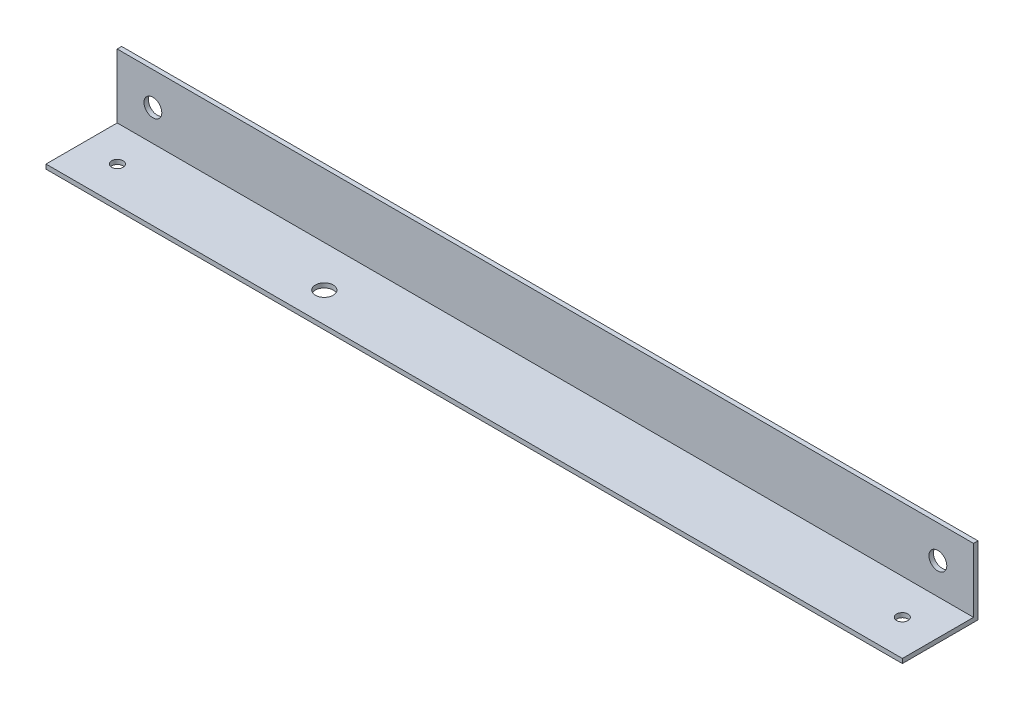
ISO-10303-21;
HEADER;
FILE_DESCRIPTION(('STEP AP214'),'2;1');
FILE_NAME('part.step','',(''),(''),'','','');
FILE_SCHEMA(('AUTOMOTIVE_DESIGN { 1 0 10303 214 1 1 1 1 }'));
ENDSEC;
DATA;
#1=APPLICATION_CONTEXT('core data for automotive mechanical design processes');
#2=APPLICATION_PROTOCOL_DEFINITION('international standard','automotive_design',2000,#1);
#3=PRODUCT_CONTEXT('',#1,'mechanical');
#4=PRODUCT('Part','Part','',(#3));
#5=PRODUCT_RELATED_PRODUCT_CATEGORY('part','',(#4));
#6=PRODUCT_DEFINITION_FORMATION('','',#4);
#7=PRODUCT_DEFINITION_CONTEXT('part definition',#1,'design');
#8=PRODUCT_DEFINITION('design','',#6,#7);
#9=PRODUCT_DEFINITION_SHAPE('','',#8);
#10=(LENGTH_UNIT() NAMED_UNIT(*) SI_UNIT(.MILLI.,.METRE.));
#11=(NAMED_UNIT(*) PLANE_ANGLE_UNIT() SI_UNIT($,.RADIAN.));
#12=(NAMED_UNIT(*) SI_UNIT($,.STERADIAN.) SOLID_ANGLE_UNIT());
#13=UNCERTAINTY_MEASURE_WITH_UNIT(LENGTH_MEASURE(1.E-05),#10,'distance_accuracy_value','');
#14=(GEOMETRIC_REPRESENTATION_CONTEXT(3) GLOBAL_UNCERTAINTY_ASSIGNED_CONTEXT((#13)) GLOBAL_UNIT_ASSIGNED_CONTEXT((#10,
#11,#12)) REPRESENTATION_CONTEXT('',''));
#15=CARTESIAN_POINT('',(0.,0.,0.));
#16=DIRECTION('',(0.,0.,1.));
#17=DIRECTION('',(1.,0.,0.));
#18=AXIS2_PLACEMENT_3D('',#15,#16,#17);
#19=CARTESIAN_POINT('',(0.,0.,26.924));
#20=DIRECTION('',(0.,0.,1.));
#21=DIRECTION('',(1.,0.,0.));
#22=AXIS2_PLACEMENT_3D('',#19,#20,#21);
#23=PLANE('',#22);
#24=DIRECTION('',(1.,0.,0.));
#25=VECTOR('',#24,1.);
#26=CARTESIAN_POINT('',(-209.826086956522,45.0420093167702,26.924));
#27=LINE('',#26,#25);
#28=CARTESIAN_POINT('',(-209.826086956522,45.0420093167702,26.924));
#29=VERTEX_POINT('',#28);
#30=CARTESIAN_POINT('',(94.9739130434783,45.0420093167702,26.924));
#31=VERTEX_POINT('',#30);
#32=EDGE_CURVE('E119',#29,#31,#27,.T.);
#33=ORIENTED_EDGE('',*,*,#32,.F.);
#34=DIRECTION('',(0.,-1.,0.));
#35=VECTOR('',#34,1.);
#36=CARTESIAN_POINT('',(-209.826086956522,67.8385093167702,26.924));
#37=LINE('',#36,#35);
#38=CARTESIAN_POINT('',(-209.826086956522,43.4545093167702,26.924));
#39=VERTEX_POINT('',#38);
#40=EDGE_CURVE('E96',#29,#39,#37,.T.);
#41=ORIENTED_EDGE('',*,*,#40,.T.);
#42=DIRECTION('',(1.,0.,0.));
#43=VECTOR('',#42,1.);
#44=CARTESIAN_POINT('',(-209.826086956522,43.4545093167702,26.924));
#45=LINE('',#44,#43);
#46=CARTESIAN_POINT('',(94.9739130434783,43.4545093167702,26.924));
#47=VERTEX_POINT('',#46);
#48=EDGE_CURVE('E58',#39,#47,#45,.T.);
#49=ORIENTED_EDGE('',*,*,#48,.T.);
#50=DIRECTION('',(0.,1.,0.));
#51=VECTOR('',#50,1.);
#52=CARTESIAN_POINT('',(94.9739130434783,67.8385093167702,26.924));
#53=LINE('',#52,#51);
#54=EDGE_CURVE('E89',#47,#31,#53,.T.);
#55=ORIENTED_EDGE('',*,*,#54,.T.);
#56=EDGE_LOOP('',(#33,#41,#49,#55));
#57=FACE_BOUND('',#56,.T.);
#58=ADVANCED_FACE('F39',(#57),#23,.T.);
#59=CARTESIAN_POINT('',(-209.826086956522,67.8385093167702,26.924));
#60=DIRECTION('',(1.,0.,0.));
#61=DIRECTION('',(0.,0.,-1.));
#62=AXIS2_PLACEMENT_3D('',#59,#60,#61);
#63=PLANE('',#62);
#64=DIRECTION('',(0.,0.,1.));
#65=VECTOR('',#64,1.);
#66=CARTESIAN_POINT('',(-209.826086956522,45.0420093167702,-303.37967743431));
#67=LINE('',#66,#65);
#68=CARTESIAN_POINT('',(-209.826086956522,45.0420093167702,1.58750000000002));
#69=VERTEX_POINT('',#68);
#70=EDGE_CURVE('E144',#69,#29,#67,.T.);
#71=ORIENTED_EDGE('',*,*,#70,.F.);
#72=DIRECTION('',(0.,1.,0.));
#73=VECTOR('',#72,1.);
#74=CARTESIAN_POINT('',(-209.826086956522,55.1385093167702,1.5875));
#75=LINE('',#74,#73);
#76=CARTESIAN_POINT('',(-209.826086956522,67.8385093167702,1.5875));
#77=VERTEX_POINT('',#76);
#78=EDGE_CURVE('E88',#69,#77,#75,.T.);
#79=ORIENTED_EDGE('',*,*,#78,.T.);
#80=DIRECTION('',(0.,0.,-1.));
#81=VECTOR('',#80,1.);
#82=CARTESIAN_POINT('',(-209.826086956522,67.8385093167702,26.924));
#83=LINE('',#82,#81);
#84=CARTESIAN_POINT('',(-209.826086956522,67.8385093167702,0.));
#85=VERTEX_POINT('',#84);
#86=EDGE_CURVE('E82',#77,#85,#83,.T.);
#87=ORIENTED_EDGE('',*,*,#86,.T.);
#88=DIRECTION('',(0.,-1.,0.));
#89=VECTOR('',#88,1.);
#90=CARTESIAN_POINT('',(-209.826086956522,67.8385093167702,0.));
#91=LINE('',#90,#89);
#92=CARTESIAN_POINT('',(-209.826086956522,43.4545093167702,0.));
#93=VERTEX_POINT('',#92);
#94=EDGE_CURVE('E86',#85,#93,#91,.T.);
#95=ORIENTED_EDGE('',*,*,#94,.T.);
#96=DIRECTION('',(0.,0.,-1.));
#97=VECTOR('',#96,1.);
#98=CARTESIAN_POINT('',(-209.826086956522,43.4545093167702,26.924));
#99=LINE('',#98,#97);
#100=EDGE_CURVE('E11',#39,#93,#99,.T.);
#101=ORIENTED_EDGE('',*,*,#100,.F.);
#102=ORIENTED_EDGE('',*,*,#40,.F.);
#103=EDGE_LOOP('',(#71,#79,#87,#95,#101,#102));
#104=FACE_BOUND('',#103,.T.);
#105=ADVANCED_FACE('F41',(#104),#63,.F.);
#106=CARTESIAN_POINT('',(-209.826086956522,43.4545093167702,26.924));
#107=DIRECTION('',(0.,1.,0.));
#108=DIRECTION('',(0.,0.,1.));
#109=AXIS2_PLACEMENT_3D('',#106,#107,#108);
#110=PLANE('',#109);
#111=CARTESIAN_POINT('',(-121.433339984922,43.4545093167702,16.256));
#112=DIRECTION('',(0.,-1.,0.));
#113=DIRECTION('',(0.,0.,-1.));
#114=AXIS2_PLACEMENT_3D('',#111,#112,#113);
#115=CIRCLE('',#114,3.175);
#116=CARTESIAN_POINT('',(-121.433339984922,43.4545093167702,13.081));
#117=VERTEX_POINT('',#116);
#118=EDGE_CURVE('E324',#117,#117,#115,.T.);
#119=ORIENTED_EDGE('',*,*,#118,.F.);
#120=EDGE_LOOP('',(#119));
#121=FACE_BOUND('',#120,.T.);
#122=CARTESIAN_POINT('',(-197.126086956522,43.4545093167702,14.224));
#123=DIRECTION('',(0.,-1.,0.));
#124=DIRECTION('',(0.,0.,-1.));
#125=AXIS2_PLACEMENT_3D('',#122,#123,#124);
#126=CIRCLE('',#125,2.03200000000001);
#127=CARTESIAN_POINT('',(-197.126086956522,43.4545093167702,12.192));
#128=VERTEX_POINT('',#127);
#129=EDGE_CURVE('E123',#128,#128,#126,.T.);
#130=ORIENTED_EDGE('',*,*,#129,.F.);
#131=EDGE_LOOP('',(#130));
#132=FACE_BOUND('',#131,.T.);
#133=CARTESIAN_POINT('',(82.2739130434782,43.4545093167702,14.224));
#134=DIRECTION('',(0.,-1.,0.));
#135=DIRECTION('',(0.,0.,1.));
#136=AXIS2_PLACEMENT_3D('',#133,#134,#135);
#137=CIRCLE('',#136,2.03200000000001);
#138=CARTESIAN_POINT('',(82.2739130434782,43.4545093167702,16.256));
#139=VERTEX_POINT('',#138);
#140=EDGE_CURVE('E327',#139,#139,#137,.T.);
#141=ORIENTED_EDGE('',*,*,#140,.F.);
#142=EDGE_LOOP('',(#141));
#143=FACE_BOUND('',#142,.T.);
#144=DIRECTION('',(1.,0.,0.));
#145=VECTOR('',#144,1.);
#146=CARTESIAN_POINT('',(-209.826086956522,43.4545093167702,0.));
#147=LINE('',#146,#145);
#148=CARTESIAN_POINT('',(94.9739130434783,43.4545093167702,0.));
#149=VERTEX_POINT('',#148);
#150=EDGE_CURVE('E100',#93,#149,#147,.T.);
#151=ORIENTED_EDGE('',*,*,#150,.T.);
#152=DIRECTION('',(0.,0.,-1.));
#153=VECTOR('',#152,1.);
#154=CARTESIAN_POINT('',(94.9739130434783,43.4545093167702,26.924));
#155=LINE('',#154,#153);
#156=EDGE_CURVE('E49',#47,#149,#155,.T.);
#157=ORIENTED_EDGE('',*,*,#156,.F.);
#158=ORIENTED_EDGE('',*,*,#48,.F.);
#159=ORIENTED_EDGE('',*,*,#100,.T.);
#160=EDGE_LOOP('',(#151,#157,#158,#159));
#161=FACE_BOUND('',#160,.T.);
#162=ADVANCED_FACE('F175',(#121,#132,#143,#161),#110,.F.);
#163=CARTESIAN_POINT('',(94.9739130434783,67.8385093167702,26.924));
#164=DIRECTION('',(-1.,0.,0.));
#165=DIRECTION('',(0.,0.,1.));
#166=AXIS2_PLACEMENT_3D('',#163,#164,#165);
#167=PLANE('',#166);
#168=DIRECTION('',(0.,1.,0.));
#169=VECTOR('',#168,1.);
#170=CARTESIAN_POINT('',(94.9739130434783,55.1385093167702,1.5875));
#171=LINE('',#170,#169);
#172=CARTESIAN_POINT('',(94.9739130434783,45.0420093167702,1.58750000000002));
#173=VERTEX_POINT('',#172);
#174=CARTESIAN_POINT('',(94.9739130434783,67.8385093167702,1.5875));
#175=VERTEX_POINT('',#174);
#176=EDGE_CURVE('E103',#173,#175,#171,.T.);
#177=ORIENTED_EDGE('',*,*,#176,.F.);
#178=DIRECTION('',(0.,0.,1.));
#179=VECTOR('',#178,1.);
#180=CARTESIAN_POINT('',(94.9739130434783,45.0420093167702,-303.37967743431));
#181=LINE('',#180,#179);
#182=EDGE_CURVE('E141',#173,#31,#181,.T.);
#183=ORIENTED_EDGE('',*,*,#182,.T.);
#184=ORIENTED_EDGE('',*,*,#54,.F.);
#185=ORIENTED_EDGE('',*,*,#156,.T.);
#186=DIRECTION('',(0.,1.,0.));
#187=VECTOR('',#186,1.);
#188=CARTESIAN_POINT('',(94.9739130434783,67.8385093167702,0.));
#189=LINE('',#188,#187);
#190=CARTESIAN_POINT('',(94.9739130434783,67.8385093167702,0.));
#191=VERTEX_POINT('',#190);
#192=EDGE_CURVE('E97',#149,#191,#189,.T.);
#193=ORIENTED_EDGE('',*,*,#192,.T.);
#194=DIRECTION('',(0.,0.,-1.));
#195=VECTOR('',#194,1.);
#196=CARTESIAN_POINT('',(94.9739130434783,67.8385093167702,26.924));
#197=LINE('',#196,#195);
#198=EDGE_CURVE('E75',#175,#191,#197,.T.);
#199=ORIENTED_EDGE('',*,*,#198,.F.);
#200=EDGE_LOOP('',(#177,#183,#184,#185,#193,#199));
#201=FACE_BOUND('',#200,.T.);
#202=ADVANCED_FACE('F161',(#201),#167,.F.);
#203=CARTESIAN_POINT('',(-209.826086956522,67.8385093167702,26.924));
#204=DIRECTION('',(0.,-1.,0.));
#205=DIRECTION('',(0.,0.,-1.));
#206=AXIS2_PLACEMENT_3D('',#203,#204,#205);
#207=PLANE('',#206);
#208=ORIENTED_EDGE('',*,*,#86,.F.);
#209=DIRECTION('',(-1.,0.,0.));
#210=VECTOR('',#209,1.);
#211=CARTESIAN_POINT('',(-209.826086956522,67.8385093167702,1.5875));
#212=LINE('',#211,#210);
#213=EDGE_CURVE('E147',#175,#77,#212,.T.);
#214=ORIENTED_EDGE('',*,*,#213,.F.);
#215=ORIENTED_EDGE('',*,*,#198,.T.);
#216=DIRECTION('',(-1.,0.,0.));
#217=VECTOR('',#216,1.);
#218=CARTESIAN_POINT('',(-209.826086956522,67.8385093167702,0.));
#219=LINE('',#218,#217);
#220=EDGE_CURVE('E92',#191,#85,#219,.T.);
#221=ORIENTED_EDGE('',*,*,#220,.T.);
#222=EDGE_LOOP('',(#208,#214,#215,#221));
#223=FACE_BOUND('',#222,.T.);
#224=ADVANCED_FACE('F93',(#223),#207,.F.);
#225=CARTESIAN_POINT('',(0.,0.,0.));
#226=DIRECTION('',(0.,0.,1.));
#227=DIRECTION('',(1.,0.,0.));
#228=AXIS2_PLACEMENT_3D('',#225,#226,#227);
#229=PLANE('',#228);
#230=CARTESIAN_POINT('',(82.2739130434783,56.1545093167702,0.));
#231=DIRECTION('',(0.,0.,-1.));
#232=DIRECTION('',(-1.,0.,0.));
#233=AXIS2_PLACEMENT_3D('',#230,#231,#232);
#234=CIRCLE('',#233,3.175);
#235=CARTESIAN_POINT('',(79.0989130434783,56.1545093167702,0.));
#236=VERTEX_POINT('',#235);
#237=EDGE_CURVE('E116',#236,#236,#234,.T.);
#238=ORIENTED_EDGE('',*,*,#237,.F.);
#239=EDGE_LOOP('',(#238));
#240=FACE_BOUND('',#239,.T.);
#241=CARTESIAN_POINT('',(-197.126086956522,56.1545093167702,0.));
#242=DIRECTION('',(0.,0.,-1.));
#243=DIRECTION('',(1.,0.,0.));
#244=AXIS2_PLACEMENT_3D('',#241,#242,#243);
#245=CIRCLE('',#244,3.17499999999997);
#246=CARTESIAN_POINT('',(-193.951086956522,56.1545093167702,0.));
#247=VERTEX_POINT('',#246);
#248=EDGE_CURVE('E125',#247,#247,#245,.T.);
#249=ORIENTED_EDGE('',*,*,#248,.F.);
#250=EDGE_LOOP('',(#249));
#251=FACE_BOUND('',#250,.T.);
#252=ORIENTED_EDGE('',*,*,#94,.F.);
#253=ORIENTED_EDGE('',*,*,#220,.F.);
#254=ORIENTED_EDGE('',*,*,#192,.F.);
#255=ORIENTED_EDGE('',*,*,#150,.F.);
#256=EDGE_LOOP('',(#252,#253,#254,#255));
#257=FACE_BOUND('',#256,.T.);
#258=ADVANCED_FACE('F99',(#240,#251,#257),#229,.F.);
#259=CARTESIAN_POINT('',(-209.826086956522,55.1385093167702,1.5875));
#260=DIRECTION('',(0.,0.,-1.));
#261=DIRECTION('',(-1.,0.,0.));
#262=AXIS2_PLACEMENT_3D('',#259,#260,#261);
#263=PLANE('',#262);
#264=CARTESIAN_POINT('',(82.2739130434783,56.1545093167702,1.5875));
#265=DIRECTION('',(0.,0.,-1.));
#266=DIRECTION('',(-1.,0.,0.));
#267=AXIS2_PLACEMENT_3D('',#264,#265,#266);
#268=CIRCLE('',#267,3.175);
#269=CARTESIAN_POINT('',(79.0989130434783,56.1545093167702,1.5875));
#270=VERTEX_POINT('',#269);
#271=EDGE_CURVE('E115',#270,#270,#268,.T.);
#272=ORIENTED_EDGE('',*,*,#271,.T.);
#273=EDGE_LOOP('',(#272));
#274=FACE_BOUND('',#273,.T.);
#275=CARTESIAN_POINT('',(-197.126086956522,56.1545093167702,1.5875));
#276=DIRECTION('',(0.,0.,-1.));
#277=DIRECTION('',(-1.,0.,0.));
#278=AXIS2_PLACEMENT_3D('',#275,#276,#277);
#279=CIRCLE('',#278,3.17499999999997);
#280=CARTESIAN_POINT('',(-200.301086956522,56.1545093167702,1.5875));
#281=VERTEX_POINT('',#280);
#282=EDGE_CURVE('E112',#281,#281,#279,.T.);
#283=ORIENTED_EDGE('',*,*,#282,.T.);
#284=EDGE_LOOP('',(#283));
#285=FACE_BOUND('',#284,.T.);
#286=ORIENTED_EDGE('',*,*,#213,.T.);
#287=ORIENTED_EDGE('',*,*,#78,.F.);
#288=DIRECTION('',(1.,0.,0.));
#289=VECTOR('',#288,1.);
#290=CARTESIAN_POINT('',(-209.826086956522,45.0420093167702,1.58750000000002));
#291=LINE('',#290,#289);
#292=EDGE_CURVE('E138',#69,#173,#291,.T.);
#293=ORIENTED_EDGE('',*,*,#292,.T.);
#294=ORIENTED_EDGE('',*,*,#176,.T.);
#295=EDGE_LOOP('',(#286,#287,#293,#294));
#296=FACE_BOUND('',#295,.T.);
#297=ADVANCED_FACE('F169',(#274,#285,#296),#263,.F.);
#298=CARTESIAN_POINT('',(-209.826086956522,45.0420093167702,-303.37967743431));
#299=DIRECTION('',(0.,-1.,0.));
#300=DIRECTION('',(0.,0.,-1.));
#301=AXIS2_PLACEMENT_3D('',#298,#299,#300);
#302=PLANE('',#301);
#303=CARTESIAN_POINT('',(-121.433339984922,45.0420093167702,16.256));
#304=DIRECTION('',(0.,-1.,0.));
#305=DIRECTION('',(0.,0.,-1.));
#306=AXIS2_PLACEMENT_3D('',#303,#304,#305);
#307=CIRCLE('',#306,3.175);
#308=CARTESIAN_POINT('',(-121.433339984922,45.0420093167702,13.081));
#309=VERTEX_POINT('',#308);
#310=EDGE_CURVE('E43',#309,#309,#307,.T.);
#311=ORIENTED_EDGE('',*,*,#310,.T.);
#312=EDGE_LOOP('',(#311));
#313=FACE_BOUND('',#312,.T.);
#314=CARTESIAN_POINT('',(-197.126086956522,45.0420093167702,14.224));
#315=DIRECTION('',(0.,-1.,0.));
#316=DIRECTION('',(0.,0.,-1.));
#317=AXIS2_PLACEMENT_3D('',#314,#315,#316);
#318=CIRCLE('',#317,2.03200000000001);
#319=CARTESIAN_POINT('',(-197.126086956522,45.0420093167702,12.192));
#320=VERTEX_POINT('',#319);
#321=EDGE_CURVE('E122',#320,#320,#318,.T.);
#322=ORIENTED_EDGE('',*,*,#321,.T.);
#323=EDGE_LOOP('',(#322));
#324=FACE_BOUND('',#323,.T.);
#325=CARTESIAN_POINT('',(82.2739130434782,45.0420093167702,14.224));
#326=DIRECTION('',(0.,-1.,0.));
#327=DIRECTION('',(0.,0.,-1.));
#328=AXIS2_PLACEMENT_3D('',#325,#326,#327);
#329=CIRCLE('',#328,2.03200000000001);
#330=CARTESIAN_POINT('',(82.2739130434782,45.0420093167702,12.192));
#331=VERTEX_POINT('',#330);
#332=EDGE_CURVE('E120',#331,#331,#329,.T.);
#333=ORIENTED_EDGE('',*,*,#332,.T.);
#334=EDGE_LOOP('',(#333));
#335=FACE_BOUND('',#334,.T.);
#336=ORIENTED_EDGE('',*,*,#70,.T.);
#337=ORIENTED_EDGE('',*,*,#32,.T.);
#338=ORIENTED_EDGE('',*,*,#182,.F.);
#339=ORIENTED_EDGE('',*,*,#292,.F.);
#340=EDGE_LOOP('',(#336,#337,#338,#339));
#341=FACE_BOUND('',#340,.T.);
#342=ADVANCED_FACE('F166',(#313,#324,#335,#341),#302,.F.);
#343=CARTESIAN_POINT('',(-197.126086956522,56.1545093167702,2.54));
#344=DIRECTION('',(0.,0.,-1.));
#345=DIRECTION('',(-1.,0.,0.));
#346=AXIS2_PLACEMENT_3D('',#343,#344,#345);
#347=CYLINDRICAL_SURFACE('',#346,3.17499999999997);
#348=ORIENTED_EDGE('',*,*,#248,.T.);
#349=EDGE_LOOP('',(#348));
#350=FACE_BOUND('',#349,.T.);
#351=ORIENTED_EDGE('',*,*,#282,.F.);
#352=EDGE_LOOP('',(#351));
#353=FACE_BOUND('',#352,.T.);
#354=ADVANCED_FACE('F226',(#350,#353),#347,.F.);
#355=CARTESIAN_POINT('',(82.2739130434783,56.1545093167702,2.54));
#356=DIRECTION('',(0.,0.,-1.));
#357=DIRECTION('',(-1.,0.,0.));
#358=AXIS2_PLACEMENT_3D('',#355,#356,#357);
#359=CYLINDRICAL_SURFACE('',#358,3.175);
#360=ORIENTED_EDGE('',*,*,#237,.T.);
#361=EDGE_LOOP('',(#360));
#362=FACE_BOUND('',#361,.T.);
#363=ORIENTED_EDGE('',*,*,#271,.F.);
#364=EDGE_LOOP('',(#363));
#365=FACE_BOUND('',#364,.T.);
#366=ADVANCED_FACE('F236',(#362,#365),#359,.F.);
#367=CARTESIAN_POINT('',(82.2739130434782,45.9945093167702,14.224));
#368=DIRECTION('',(0.,-1.,0.));
#369=DIRECTION('',(0.,0.,-1.));
#370=AXIS2_PLACEMENT_3D('',#367,#368,#369);
#371=CYLINDRICAL_SURFACE('',#370,2.03200000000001);
#372=ORIENTED_EDGE('',*,*,#140,.T.);
#373=EDGE_LOOP('',(#372));
#374=FACE_BOUND('',#373,.T.);
#375=ORIENTED_EDGE('',*,*,#332,.F.);
#376=EDGE_LOOP('',(#375));
#377=FACE_BOUND('',#376,.T.);
#378=ADVANCED_FACE('F242',(#374,#377),#371,.F.);
#379=CARTESIAN_POINT('',(-197.126086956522,45.9945093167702,14.224));
#380=DIRECTION('',(0.,-1.,0.));
#381=DIRECTION('',(0.,0.,-1.));
#382=AXIS2_PLACEMENT_3D('',#379,#380,#381);
#383=CYLINDRICAL_SURFACE('',#382,2.03200000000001);
#384=ORIENTED_EDGE('',*,*,#129,.T.);
#385=EDGE_LOOP('',(#384));
#386=FACE_BOUND('',#385,.T.);
#387=ORIENTED_EDGE('',*,*,#321,.F.);
#388=EDGE_LOOP('',(#387));
#389=FACE_BOUND('',#388,.T.);
#390=ADVANCED_FACE('F250',(#386,#389),#383,.F.);
#391=CARTESIAN_POINT('',(-121.433339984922,45.9945093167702,16.256));
#392=DIRECTION('',(0.,-1.,0.));
#393=DIRECTION('',(0.,0.,-1.));
#394=AXIS2_PLACEMENT_3D('',#391,#392,#393);
#395=CYLINDRICAL_SURFACE('',#394,3.175);
#396=ORIENTED_EDGE('',*,*,#118,.T.);
#397=EDGE_LOOP('',(#396));
#398=FACE_BOUND('',#397,.T.);
#399=ORIENTED_EDGE('',*,*,#310,.F.);
#400=EDGE_LOOP('',(#399));
#401=FACE_BOUND('',#400,.T.);
#402=ADVANCED_FACE('F257',(#398,#401),#395,.F.);
#403=CLOSED_SHELL('',(#58,#105,#162,#202,#224,#258,#297,#342,#354,#366,#378,#390,#402));
#404=MANIFOLD_SOLID_BREP('B2',#403);
#405=ADVANCED_BREP_SHAPE_REPRESENTATION('',(#18,#404),#14);
#406=SHAPE_DEFINITION_REPRESENTATION(#9,#405);
ENDSEC;
END-ISO-10303-21;
